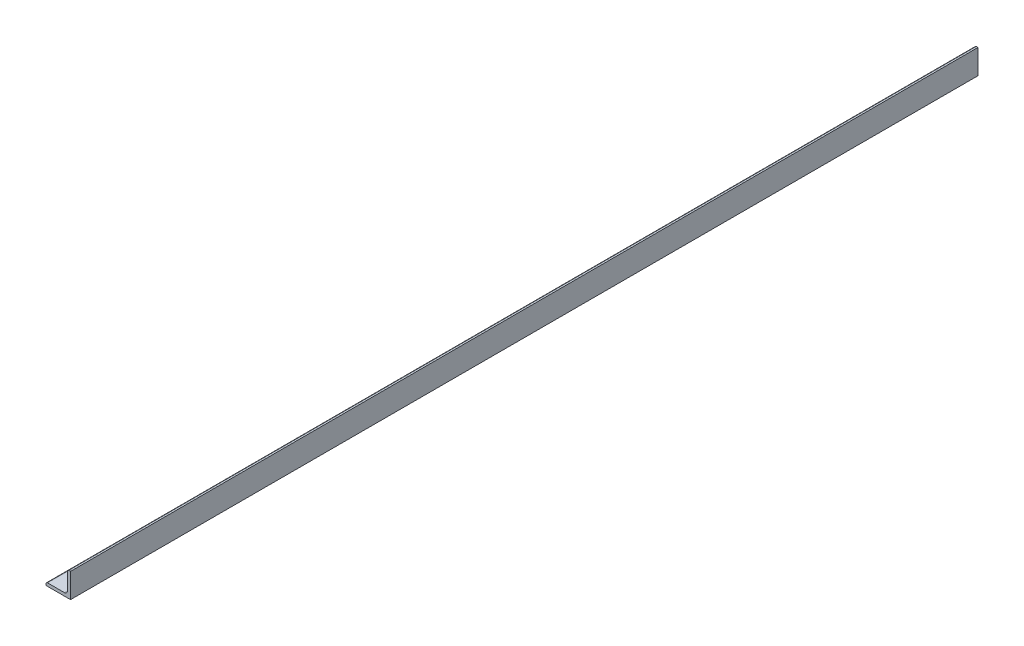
ISO-10303-21;
HEADER;
FILE_DESCRIPTION(('STEP AP214'),'2;1');
FILE_NAME('part.step','',(''),(''),'','','');
FILE_SCHEMA(('AUTOMOTIVE_DESIGN { 1 0 10303 214 1 1 1 1 }'));
ENDSEC;
DATA;
#1=APPLICATION_CONTEXT('core data for automotive mechanical design processes');
#2=APPLICATION_PROTOCOL_DEFINITION('international standard','automotive_design',2000,#1);
#3=PRODUCT_CONTEXT('',#1,'mechanical');
#4=PRODUCT('Part','Part','',(#3));
#5=PRODUCT_RELATED_PRODUCT_CATEGORY('part','',(#4));
#6=PRODUCT_DEFINITION_FORMATION('','',#4);
#7=PRODUCT_DEFINITION_CONTEXT('part definition',#1,'design');
#8=PRODUCT_DEFINITION('design','',#6,#7);
#9=PRODUCT_DEFINITION_SHAPE('','',#8);
#10=(LENGTH_UNIT() NAMED_UNIT(*) SI_UNIT(.MILLI.,.METRE.));
#11=(NAMED_UNIT(*) PLANE_ANGLE_UNIT() SI_UNIT($,.RADIAN.));
#12=(NAMED_UNIT(*) SI_UNIT($,.STERADIAN.) SOLID_ANGLE_UNIT());
#13=UNCERTAINTY_MEASURE_WITH_UNIT(LENGTH_MEASURE(1.E-05),#10,'distance_accuracy_value','');
#14=(GEOMETRIC_REPRESENTATION_CONTEXT(3) GLOBAL_UNCERTAINTY_ASSIGNED_CONTEXT((#13)) GLOBAL_UNIT_ASSIGNED_CONTEXT((#10,
#11,#12)) REPRESENTATION_CONTEXT('',''));
#15=CARTESIAN_POINT('',(0.,0.,0.));
#16=DIRECTION('',(0.,0.,1.));
#17=DIRECTION('',(1.,0.,0.));
#18=AXIS2_PLACEMENT_3D('',#15,#16,#17);
#19=CARTESIAN_POINT('',(-6.35,-5.55625000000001,234.95));
#20=DIRECTION('',(1.,0.,0.));
#21=DIRECTION('',(0.,0.,-1.));
#22=AXIS2_PLACEMENT_3D('',#19,#20,#21);
#23=PLANE('',#22);
#24=DIRECTION('',(0.,-1.,0.));
#25=VECTOR('',#24,1.);
#26=CARTESIAN_POINT('',(-6.35,-5.55625000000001,-234.95));
#27=LINE('',#26,#25);
#28=CARTESIAN_POINT('',(-6.35,-5.55625000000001,-234.95));
#29=VERTEX_POINT('',#28);
#30=CARTESIAN_POINT('',(-6.35,-6.35,-234.95));
#31=VERTEX_POINT('',#30);
#32=EDGE_CURVE('E137',#29,#31,#27,.T.);
#33=ORIENTED_EDGE('',*,*,#32,.T.);
#34=DIRECTION('',(0.,0.,-1.));
#35=VECTOR('',#34,1.);
#36=CARTESIAN_POINT('',(-6.35,-6.35,234.95));
#37=LINE('',#36,#35);
#38=CARTESIAN_POINT('',(-6.35,-6.35,234.95));
#39=VERTEX_POINT('',#38);
#40=EDGE_CURVE('E11',#39,#31,#37,.T.);
#41=ORIENTED_EDGE('',*,*,#40,.F.);
#42=DIRECTION('',(0.,-1.,0.));
#43=VECTOR('',#42,1.);
#44=CARTESIAN_POINT('',(-6.35,-5.55625000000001,234.95));
#45=LINE('',#44,#43);
#46=CARTESIAN_POINT('',(-6.35,-5.55625000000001,234.95));
#47=VERTEX_POINT('',#46);
#48=EDGE_CURVE('E153',#47,#39,#45,.T.);
#49=ORIENTED_EDGE('',*,*,#48,.F.);
#50=DIRECTION('',(0.,0.,-1.));
#51=VECTOR('',#50,1.);
#52=CARTESIAN_POINT('',(-6.35,-5.55625000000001,234.95));
#53=LINE('',#52,#51);
#54=EDGE_CURVE('E133',#47,#29,#53,.T.);
#55=ORIENTED_EDGE('',*,*,#54,.T.);
#56=EDGE_LOOP('',(#33,#41,#49,#55));
#57=FACE_BOUND('',#56,.T.);
#58=ADVANCED_FACE('F35',(#57),#23,.F.);
#59=CARTESIAN_POINT('',(-6.35,-6.35,234.95));
#60=DIRECTION('',(0.,1.,0.));
#61=DIRECTION('',(-1.,0.,0.));
#62=AXIS2_PLACEMENT_3D('',#59,#60,#61);
#63=PLANE('',#62);
#64=DIRECTION('',(1.,0.,0.));
#65=VECTOR('',#64,1.);
#66=CARTESIAN_POINT('',(-6.35,-6.35,-234.95));
#67=LINE('',#66,#65);
#68=CARTESIAN_POINT('',(6.35,-6.35,-234.95));
#69=VERTEX_POINT('',#68);
#70=EDGE_CURVE('E140',#31,#69,#67,.T.);
#71=ORIENTED_EDGE('',*,*,#70,.T.);
#72=DIRECTION('',(0.,0.,-1.));
#73=VECTOR('',#72,1.);
#74=CARTESIAN_POINT('',(6.35,-6.35,234.95));
#75=LINE('',#74,#73);
#76=CARTESIAN_POINT('',(6.35,-6.35,234.95));
#77=VERTEX_POINT('',#76);
#78=EDGE_CURVE('E43',#77,#69,#75,.T.);
#79=ORIENTED_EDGE('',*,*,#78,.F.);
#80=DIRECTION('',(1.,0.,0.));
#81=VECTOR('',#80,1.);
#82=CARTESIAN_POINT('',(-6.35,-6.35,234.95));
#83=LINE('',#82,#81);
#84=EDGE_CURVE('E97',#39,#77,#83,.T.);
#85=ORIENTED_EDGE('',*,*,#84,.F.);
#86=ORIENTED_EDGE('',*,*,#40,.T.);
#87=EDGE_LOOP('',(#71,#79,#85,#86));
#88=FACE_BOUND('',#87,.T.);
#89=ADVANCED_FACE('F196',(#88),#63,.F.);
#90=CARTESIAN_POINT('',(6.35,-6.35,234.95));
#91=DIRECTION('',(-1.,0.,0.));
#92=DIRECTION('',(0.,-1.,0.));
#93=AXIS2_PLACEMENT_3D('',#90,#91,#92);
#94=PLANE('',#93);
#95=DIRECTION('',(0.,1.,0.));
#96=VECTOR('',#95,1.);
#97=CARTESIAN_POINT('',(6.35,-6.35,-234.95));
#98=LINE('',#97,#96);
#99=CARTESIAN_POINT('',(6.35,6.35,-234.95));
#100=VERTEX_POINT('',#99);
#101=EDGE_CURVE('E142',#69,#100,#98,.T.);
#102=ORIENTED_EDGE('',*,*,#101,.T.);
#103=DIRECTION('',(0.,0.,-1.));
#104=VECTOR('',#103,1.);
#105=CARTESIAN_POINT('',(6.35,6.35,234.95));
#106=LINE('',#105,#104);
#107=CARTESIAN_POINT('',(6.35,6.35,234.95));
#108=VERTEX_POINT('',#107);
#109=EDGE_CURVE('E163',#108,#100,#106,.T.);
#110=ORIENTED_EDGE('',*,*,#109,.F.);
#111=DIRECTION('',(0.,1.,0.));
#112=VECTOR('',#111,1.);
#113=CARTESIAN_POINT('',(6.35,-6.35,234.95));
#114=LINE('',#113,#112);
#115=EDGE_CURVE('E171',#77,#108,#114,.T.);
#116=ORIENTED_EDGE('',*,*,#115,.F.);
#117=ORIENTED_EDGE('',*,*,#78,.T.);
#118=EDGE_LOOP('',(#102,#110,#116,#117));
#119=FACE_BOUND('',#118,.T.);
#120=ADVANCED_FACE('F169',(#119),#94,.F.);
#121=CARTESIAN_POINT('',(5.55625000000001,6.35,234.95));
#122=DIRECTION('',(0.,-1.,0.));
#123=DIRECTION('',(1.,0.,0.));
#124=AXIS2_PLACEMENT_3D('',#121,#122,#123);
#125=PLANE('',#124);
#126=DIRECTION('',(-1.,0.,0.));
#127=VECTOR('',#126,1.);
#128=CARTESIAN_POINT('',(5.55625000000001,6.35,-234.95));
#129=LINE('',#128,#127);
#130=CARTESIAN_POINT('',(5.55625000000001,6.35,-234.95));
#131=VERTEX_POINT('',#130);
#132=EDGE_CURVE('E144',#100,#131,#129,.T.);
#133=ORIENTED_EDGE('',*,*,#132,.T.);
#134=DIRECTION('',(0.,0.,-1.));
#135=VECTOR('',#134,1.);
#136=CARTESIAN_POINT('',(5.55625000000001,6.35,234.95));
#137=LINE('',#136,#135);
#138=CARTESIAN_POINT('',(5.55625000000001,6.35,234.95));
#139=VERTEX_POINT('',#138);
#140=EDGE_CURVE('E160',#139,#131,#137,.T.);
#141=ORIENTED_EDGE('',*,*,#140,.F.);
#142=DIRECTION('',(-1.,0.,0.));
#143=VECTOR('',#142,1.);
#144=CARTESIAN_POINT('',(5.55625000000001,6.35,234.95));
#145=LINE('',#144,#143);
#146=EDGE_CURVE('E187',#108,#139,#145,.T.);
#147=ORIENTED_EDGE('',*,*,#146,.F.);
#148=ORIENTED_EDGE('',*,*,#109,.T.);
#149=EDGE_LOOP('',(#133,#141,#147,#148));
#150=FACE_BOUND('',#149,.T.);
#151=ADVANCED_FACE('F180',(#150),#125,.F.);
#152=CARTESIAN_POINT('',(5.55625000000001,5.55625000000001,234.95));
#153=DIRECTION('',(0.,0.,-1.));
#154=DIRECTION('',(-1.,0.,0.));
#155=AXIS2_PLACEMENT_3D('',#152,#153,#154);
#156=CYLINDRICAL_SURFACE('',#155,0.793749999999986);
#157=CARTESIAN_POINT('',(5.55625000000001,5.55625000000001,-234.95));
#158=DIRECTION('',(0.,0.,1.));
#159=DIRECTION('',(-1.,0.,0.));
#160=AXIS2_PLACEMENT_3D('',#157,#158,#159);
#161=CIRCLE('',#160,0.793749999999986);
#162=CARTESIAN_POINT('',(4.76250000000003,5.55625000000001,-234.95));
#163=VERTEX_POINT('',#162);
#164=EDGE_CURVE('E146',#131,#163,#161,.T.);
#165=ORIENTED_EDGE('',*,*,#164,.T.);
#166=DIRECTION('',(0.,0.,-1.));
#167=VECTOR('',#166,1.);
#168=CARTESIAN_POINT('',(4.76250000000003,5.55625000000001,234.95));
#169=LINE('',#168,#167);
#170=CARTESIAN_POINT('',(4.76250000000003,5.55625000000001,234.95));
#171=VERTEX_POINT('',#170);
#172=EDGE_CURVE('E157',#171,#163,#169,.T.);
#173=ORIENTED_EDGE('',*,*,#172,.F.);
#174=CARTESIAN_POINT('',(5.55625000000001,5.55625000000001,234.95));
#175=DIRECTION('',(0.,0.,1.));
#176=DIRECTION('',(-1.,0.,0.));
#177=AXIS2_PLACEMENT_3D('',#174,#175,#176);
#178=CIRCLE('',#177,0.793749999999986);
#179=EDGE_CURVE('E186',#139,#171,#178,.T.);
#180=ORIENTED_EDGE('',*,*,#179,.F.);
#181=ORIENTED_EDGE('',*,*,#140,.T.);
#182=EDGE_LOOP('',(#165,#173,#180,#181));
#183=FACE_BOUND('',#182,.T.);
#184=ADVANCED_FACE('F184',(#183),#156,.T.);
#185=CARTESIAN_POINT('',(4.76250000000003,5.55625000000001,234.95));
#186=DIRECTION('',(1.,0.,0.));
#187=DIRECTION('',(0.,1.,0.));
#188=AXIS2_PLACEMENT_3D('',#185,#186,#187);
#189=PLANE('',#188);
#190=DIRECTION('',(0.,-1.,0.));
#191=VECTOR('',#190,1.);
#192=CARTESIAN_POINT('',(4.76250000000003,5.55625000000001,-234.95));
#193=LINE('',#192,#191);
#194=CARTESIAN_POINT('',(4.76250000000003,-3.18770000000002,-234.95));
#195=VERTEX_POINT('',#194);
#196=EDGE_CURVE('E148',#163,#195,#193,.T.);
#197=ORIENTED_EDGE('',*,*,#196,.T.);
#198=DIRECTION('',(0.,0.,-1.));
#199=VECTOR('',#198,1.);
#200=CARTESIAN_POINT('',(4.76250000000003,-3.18770000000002,234.95));
#201=LINE('',#200,#199);
#202=CARTESIAN_POINT('',(4.76250000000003,-3.18770000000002,234.95));
#203=VERTEX_POINT('',#202);
#204=EDGE_CURVE('E128',#203,#195,#201,.T.);
#205=ORIENTED_EDGE('',*,*,#204,.F.);
#206=DIRECTION('',(0.,-1.,0.));
#207=VECTOR('',#206,1.);
#208=CARTESIAN_POINT('',(4.76250000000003,5.55625000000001,234.95));
#209=LINE('',#208,#207);
#210=EDGE_CURVE('E119',#171,#203,#209,.T.);
#211=ORIENTED_EDGE('',*,*,#210,.F.);
#212=ORIENTED_EDGE('',*,*,#172,.T.);
#213=EDGE_LOOP('',(#197,#205,#211,#212));
#214=FACE_BOUND('',#213,.T.);
#215=ADVANCED_FACE('F208',(#214),#189,.F.);
#216=CARTESIAN_POINT('',(3.18770000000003,-3.18770000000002,234.95));
#217=DIRECTION('',(0.,0.,-1.));
#218=DIRECTION('',(-1.,0.,0.));
#219=AXIS2_PLACEMENT_3D('',#216,#217,#218);
#220=CYLINDRICAL_SURFACE('',#219,1.5748);
#221=CARTESIAN_POINT('',(3.18770000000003,-3.18770000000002,-234.95));
#222=DIRECTION('',(0.,0.,-1.));
#223=DIRECTION('',(-1.,0.,0.));
#224=AXIS2_PLACEMENT_3D('',#221,#222,#223);
#225=CIRCLE('',#224,1.5748);
#226=CARTESIAN_POINT('',(3.18770000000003,-4.76250000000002,-234.95));
#227=VERTEX_POINT('',#226);
#228=EDGE_CURVE('E127',#195,#227,#225,.T.);
#229=ORIENTED_EDGE('',*,*,#228,.T.);
#230=DIRECTION('',(0.,0.,-1.));
#231=VECTOR('',#230,1.);
#232=CARTESIAN_POINT('',(3.18770000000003,-4.76250000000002,234.95));
#233=LINE('',#232,#231);
#234=CARTESIAN_POINT('',(3.18770000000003,-4.76250000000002,234.95));
#235=VERTEX_POINT('',#234);
#236=EDGE_CURVE('E124',#235,#227,#233,.T.);
#237=ORIENTED_EDGE('',*,*,#236,.F.);
#238=CARTESIAN_POINT('',(3.18770000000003,-3.18770000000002,234.95));
#239=DIRECTION('',(0.,0.,-1.));
#240=DIRECTION('',(-1.,0.,0.));
#241=AXIS2_PLACEMENT_3D('',#238,#239,#240);
#242=CIRCLE('',#241,1.5748);
#243=EDGE_CURVE('E113',#203,#235,#242,.T.);
#244=ORIENTED_EDGE('',*,*,#243,.F.);
#245=ORIENTED_EDGE('',*,*,#204,.T.);
#246=EDGE_LOOP('',(#229,#237,#244,#245));
#247=FACE_BOUND('',#246,.T.);
#248=ADVANCED_FACE('F125',(#247),#220,.F.);
#249=CARTESIAN_POINT('',(3.18770000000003,-4.76250000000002,234.95));
#250=DIRECTION('',(0.,-1.,0.));
#251=DIRECTION('',(1.,0.,0.));
#252=AXIS2_PLACEMENT_3D('',#249,#250,#251);
#253=PLANE('',#252);
#254=DIRECTION('',(-1.,0.,0.));
#255=VECTOR('',#254,1.);
#256=CARTESIAN_POINT('',(3.18770000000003,-4.76250000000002,-234.95));
#257=LINE('',#256,#255);
#258=CARTESIAN_POINT('',(-5.55625000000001,-4.76250000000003,-234.95));
#259=VERTEX_POINT('',#258);
#260=EDGE_CURVE('E83',#227,#259,#257,.T.);
#261=ORIENTED_EDGE('',*,*,#260,.T.);
#262=DIRECTION('',(0.,0.,-1.));
#263=VECTOR('',#262,1.);
#264=CARTESIAN_POINT('',(-5.55625000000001,-4.76250000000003,234.95));
#265=LINE('',#264,#263);
#266=CARTESIAN_POINT('',(-5.55625000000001,-4.76250000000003,234.95));
#267=VERTEX_POINT('',#266);
#268=EDGE_CURVE('E129',#267,#259,#265,.T.);
#269=ORIENTED_EDGE('',*,*,#268,.F.);
#270=DIRECTION('',(-1.,0.,0.));
#271=VECTOR('',#270,1.);
#272=CARTESIAN_POINT('',(3.18770000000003,-4.76250000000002,234.95));
#273=LINE('',#272,#271);
#274=EDGE_CURVE('E117',#235,#267,#273,.T.);
#275=ORIENTED_EDGE('',*,*,#274,.F.);
#276=ORIENTED_EDGE('',*,*,#236,.T.);
#277=EDGE_LOOP('',(#261,#269,#275,#276));
#278=FACE_BOUND('',#277,.T.);
#279=ADVANCED_FACE('F131',(#278),#253,.F.);
#280=CARTESIAN_POINT('',(-5.55625000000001,-5.55625000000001,234.95));
#281=DIRECTION('',(0.,0.,-1.));
#282=DIRECTION('',(-1.,0.,0.));
#283=AXIS2_PLACEMENT_3D('',#280,#281,#282);
#284=CYLINDRICAL_SURFACE('',#283,0.793749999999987);
#285=CARTESIAN_POINT('',(-5.55625000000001,-5.55625000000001,-234.95));
#286=DIRECTION('',(0.,0.,1.));
#287=DIRECTION('',(-1.,0.,0.));
#288=AXIS2_PLACEMENT_3D('',#285,#286,#287);
#289=CIRCLE('',#288,0.793749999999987);
#290=EDGE_CURVE('E89',#259,#29,#289,.T.);
#291=ORIENTED_EDGE('',*,*,#290,.T.);
#292=ORIENTED_EDGE('',*,*,#54,.F.);
#293=CARTESIAN_POINT('',(-5.55625000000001,-5.55625000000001,234.95));
#294=DIRECTION('',(0.,0.,1.));
#295=DIRECTION('',(-1.,0.,0.));
#296=AXIS2_PLACEMENT_3D('',#293,#294,#295);
#297=CIRCLE('',#296,0.793749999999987);
#298=EDGE_CURVE('E51',#267,#47,#297,.T.);
#299=ORIENTED_EDGE('',*,*,#298,.F.);
#300=ORIENTED_EDGE('',*,*,#268,.T.);
#301=EDGE_LOOP('',(#291,#292,#299,#300));
#302=FACE_BOUND('',#301,.T.);
#303=ADVANCED_FACE('F216',(#302),#284,.T.);
#304=CARTESIAN_POINT('',(5.55625000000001,5.55625000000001,234.95));
#305=DIRECTION('',(0.,0.,-1.));
#306=DIRECTION('',(-1.,0.,0.));
#307=AXIS2_PLACEMENT_3D('',#304,#305,#306);
#308=PLANE('',#307);
#309=ORIENTED_EDGE('',*,*,#48,.T.);
#310=ORIENTED_EDGE('',*,*,#84,.T.);
#311=ORIENTED_EDGE('',*,*,#115,.T.);
#312=ORIENTED_EDGE('',*,*,#146,.T.);
#313=ORIENTED_EDGE('',*,*,#179,.T.);
#314=ORIENTED_EDGE('',*,*,#210,.T.);
#315=ORIENTED_EDGE('',*,*,#243,.T.);
#316=ORIENTED_EDGE('',*,*,#274,.T.);
#317=ORIENTED_EDGE('',*,*,#298,.T.);
#318=EDGE_LOOP('',(#309,#310,#311,#312,#313,#314,#315,#316,#317));
#319=FACE_BOUND('',#318,.T.);
#320=ADVANCED_FACE('F115',(#319),#308,.F.);
#321=CARTESIAN_POINT('',(5.55625000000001,5.55625000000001,-234.95));
#322=DIRECTION('',(0.,0.,-1.));
#323=DIRECTION('',(-1.,0.,0.));
#324=AXIS2_PLACEMENT_3D('',#321,#322,#323);
#325=PLANE('',#324);
#326=ORIENTED_EDGE('',*,*,#32,.F.);
#327=ORIENTED_EDGE('',*,*,#290,.F.);
#328=ORIENTED_EDGE('',*,*,#260,.F.);
#329=ORIENTED_EDGE('',*,*,#228,.F.);
#330=ORIENTED_EDGE('',*,*,#196,.F.);
#331=ORIENTED_EDGE('',*,*,#164,.F.);
#332=ORIENTED_EDGE('',*,*,#132,.F.);
#333=ORIENTED_EDGE('',*,*,#101,.F.);
#334=ORIENTED_EDGE('',*,*,#70,.F.);
#335=EDGE_LOOP('',(#326,#327,#328,#329,#330,#331,#332,#333,#334));
#336=FACE_BOUND('',#335,.T.);
#337=ADVANCED_FACE('F175',(#336),#325,.T.);
#338=CLOSED_SHELL('',(#58,#89,#120,#151,#184,#215,#248,#279,#303,#320,#337));
#339=MANIFOLD_SOLID_BREP('B2',#338);
#340=ADVANCED_BREP_SHAPE_REPRESENTATION('',(#18,#339),#14);
#341=SHAPE_DEFINITION_REPRESENTATION(#9,#340);
ENDSEC;
END-ISO-10303-21;
